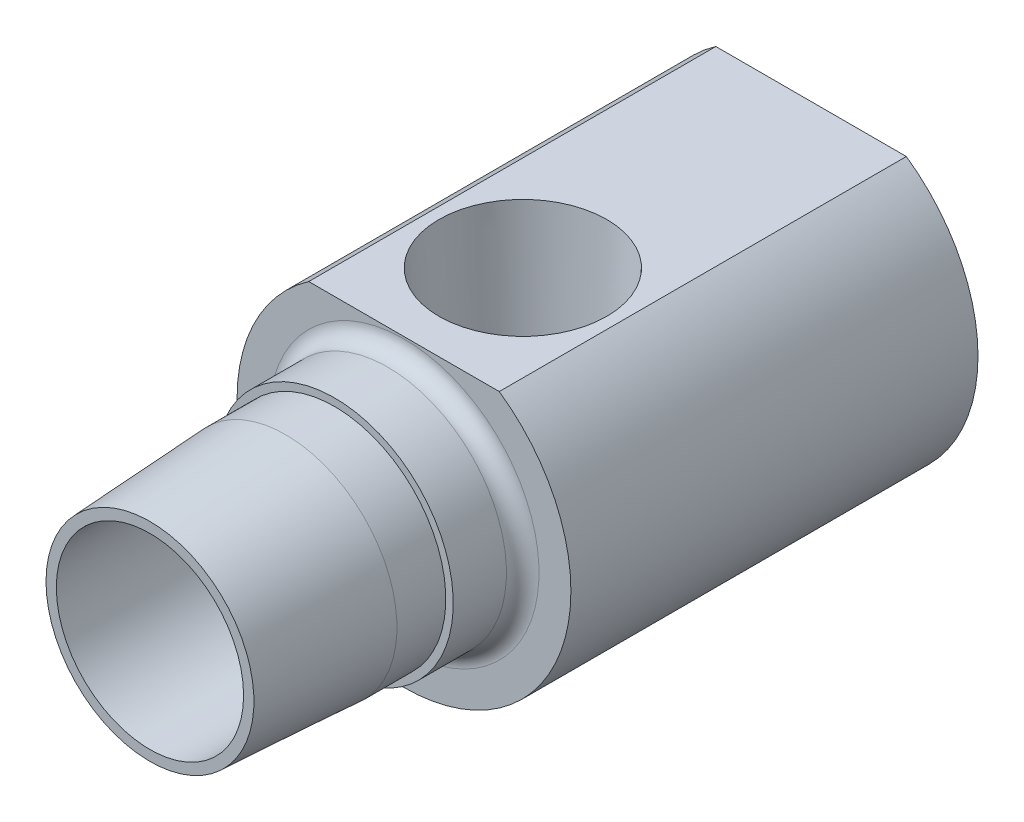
ISO-10303-21;
HEADER;
FILE_DESCRIPTION(('STEP AP214'),'2;1');
FILE_NAME('part.step','',(''),(''),'','','');
FILE_SCHEMA(('AUTOMOTIVE_DESIGN { 1 0 10303 214 1 1 1 1 }'));
ENDSEC;
DATA;
#1=APPLICATION_CONTEXT('core data for automotive mechanical design processes');
#2=APPLICATION_PROTOCOL_DEFINITION('international standard','automotive_design',2000,#1);
#3=PRODUCT_CONTEXT('',#1,'mechanical');
#4=PRODUCT('Part','Part','',(#3));
#5=PRODUCT_RELATED_PRODUCT_CATEGORY('part','',(#4));
#6=PRODUCT_DEFINITION_FORMATION('','',#4);
#7=PRODUCT_DEFINITION_CONTEXT('part definition',#1,'design');
#8=PRODUCT_DEFINITION('design','',#6,#7);
#9=PRODUCT_DEFINITION_SHAPE('','',#8);
#10=(LENGTH_UNIT() NAMED_UNIT(*) SI_UNIT(.MILLI.,.METRE.));
#11=(NAMED_UNIT(*) PLANE_ANGLE_UNIT() SI_UNIT($,.RADIAN.));
#12=(NAMED_UNIT(*) SI_UNIT($,.STERADIAN.) SOLID_ANGLE_UNIT());
#13=UNCERTAINTY_MEASURE_WITH_UNIT(LENGTH_MEASURE(1.E-05),#10,'distance_accuracy_value','');
#14=(GEOMETRIC_REPRESENTATION_CONTEXT(3) GLOBAL_UNCERTAINTY_ASSIGNED_CONTEXT((#13)) GLOBAL_UNIT_ASSIGNED_CONTEXT((#10,
#11,#12)) REPRESENTATION_CONTEXT('',''));
#15=CARTESIAN_POINT('',(0.,0.,0.));
#16=DIRECTION('',(0.,0.,1.));
#17=DIRECTION('',(1.,0.,0.));
#18=AXIS2_PLACEMENT_3D('',#15,#16,#17);
#19=CARTESIAN_POINT('',(-4.3815,0.,-8.636));
#20=DIRECTION('',(0.,0.,1.));
#21=DIRECTION('',(1.,0.,0.));
#22=AXIS2_PLACEMENT_3D('',#19,#20,#21);
#23=PLANE('',#22);
#24=CARTESIAN_POINT('',(0.,0.,-8.636));
#25=DIRECTION('',(0.,0.,-1.));
#26=DIRECTION('',(-1.,0.,0.));
#27=AXIS2_PLACEMENT_3D('',#24,#25,#26);
#28=CIRCLE('',#27,4.3815);
#29=CARTESIAN_POINT('',(-4.3815,0.,-8.636));
#30=VERTEX_POINT('',#29);
#31=EDGE_CURVE('E277',#30,#30,#28,.T.);
#32=ORIENTED_EDGE('',*,*,#31,.F.);
#33=EDGE_LOOP('',(#32));
#34=FACE_BOUND('',#33,.T.);
#35=CARTESIAN_POINT('',(0.,-0.127883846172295,-8.636));
#36=DIRECTION('',(0.,0.,1.));
#37=DIRECTION('',(0.,1.,0.));
#38=AXIS2_PLACEMENT_3D('',#35,#36,#37);
#39=ELLIPSE('',#38,3.14947653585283,3.00160671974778);
#40=CARTESIAN_POINT('',(0.,3.02159268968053,-8.636));
#41=VERTEX_POINT('',#40);
#42=EDGE_CURVE('E216',#41,#41,#39,.F.);
#43=ORIENTED_EDGE('',*,*,#42,.T.);
#44=EDGE_LOOP('',(#43));
#45=FACE_BOUND('',#44,.T.);
#46=ADVANCED_FACE('F16',(#34,#45),#23,.T.);
#47=CARTESIAN_POINT('',(-5.207,0.,-8.636));
#48=DIRECTION('',(0.,0.,1.));
#49=DIRECTION('',(1.,0.,0.));
#50=AXIS2_PLACEMENT_3D('',#47,#48,#49);
#51=PLANE('',#50);
#52=CARTESIAN_POINT('',(0.,0.,-8.636));
#53=DIRECTION('',(0.,0.,-1.));
#54=DIRECTION('',(-1.,0.,0.));
#55=AXIS2_PLACEMENT_3D('',#52,#53,#54);
#56=CIRCLE('',#55,5.207);
#57=CARTESIAN_POINT('',(-5.207,0.,-8.636));
#58=VERTEX_POINT('',#57);
#59=EDGE_CURVE('E267',#58,#58,#56,.T.);
#60=ORIENTED_EDGE('',*,*,#59,.T.);
#61=EDGE_LOOP('',(#60));
#62=FACE_BOUND('',#61,.T.);
#63=CARTESIAN_POINT('',(0.,0.,-8.636));
#64=DIRECTION('',(0.,0.,-1.));
#65=DIRECTION('',(-1.,0.,0.));
#66=AXIS2_PLACEMENT_3D('',#63,#64,#65);
#67=CIRCLE('',#66,5.55625);
#68=CARTESIAN_POINT('',(-5.55625,0.,-8.636));
#69=VERTEX_POINT('',#68);
#70=EDGE_CURVE('E292',#69,#69,#67,.T.);
#71=ORIENTED_EDGE('',*,*,#70,.F.);
#72=EDGE_LOOP('',(#71));
#73=FACE_BOUND('',#72,.T.);
#74=ADVANCED_FACE('F18',(#62,#73),#51,.T.);
#75=CARTESIAN_POINT('',(0.,0.,-75.1971669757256));
#76=DIRECTION('',(0.,0.,-1.));
#77=DIRECTION('',(-1.,0.,0.));
#78=AXIS2_PLACEMENT_3D('',#75,#76,#77);
#79=CYLINDRICAL_SURFACE('',#78,5.207);
#80=CARTESIAN_POINT('',(0.,0.,-6.35));
#81=DIRECTION('',(0.,0.,-1.));
#82=DIRECTION('',(-1.,0.,0.));
#83=AXIS2_PLACEMENT_3D('',#80,#81,#82);
#84=CIRCLE('',#83,5.207);
#85=CARTESIAN_POINT('',(-5.207,0.,-6.35));
#86=VERTEX_POINT('',#85);
#87=EDGE_CURVE('E264',#86,#86,#84,.T.);
#88=ORIENTED_EDGE('',*,*,#87,.T.);
#89=EDGE_LOOP('',(#88));
#90=FACE_BOUND('',#89,.T.);
#91=ORIENTED_EDGE('',*,*,#59,.F.);
#92=EDGE_LOOP('',(#91));
#93=FACE_BOUND('',#92,.T.);
#94=ADVANCED_FACE('F238',(#90,#93),#79,.T.);
#95=CARTESIAN_POINT('',(0.,0.,-6.35));
#96=DIRECTION('',(0.,0.,-1.));
#97=DIRECTION('',(-1.,0.,0.));
#98=AXIS2_PLACEMENT_3D('',#95,#96,#97);
#99=CONICAL_SURFACE('',#98,5.207,0.0538619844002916);
#100=CARTESIAN_POINT('',(0.,0.,0.));
#101=DIRECTION('',(0.,0.,-1.));
#102=DIRECTION('',(-1.,0.,0.));
#103=AXIS2_PLACEMENT_3D('',#100,#101,#102);
#104=CIRCLE('',#103,4.86464526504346);
#105=CARTESIAN_POINT('',(-4.86464526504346,0.,0.));
#106=VERTEX_POINT('',#105);
#107=EDGE_CURVE('E269',#106,#106,#104,.T.);
#108=ORIENTED_EDGE('',*,*,#107,.T.);
#109=EDGE_LOOP('',(#108));
#110=FACE_BOUND('',#109,.T.);
#111=ORIENTED_EDGE('',*,*,#87,.F.);
#112=EDGE_LOOP('',(#111));
#113=FACE_BOUND('',#112,.T.);
#114=ADVANCED_FACE('F253',(#110,#113),#99,.T.);
#115=CARTESIAN_POINT('',(-4.3815,0.,0.));
#116=DIRECTION('',(0.,0.,1.));
#117=DIRECTION('',(1.,0.,0.));
#118=AXIS2_PLACEMENT_3D('',#115,#116,#117);
#119=PLANE('',#118);
#120=CARTESIAN_POINT('',(0.,0.,0.));
#121=DIRECTION('',(0.,0.,-1.));
#122=DIRECTION('',(-1.,0.,0.));
#123=AXIS2_PLACEMENT_3D('',#120,#121,#122);
#124=CIRCLE('',#123,4.3815);
#125=CARTESIAN_POINT('',(-4.3815,0.,0.));
#126=VERTEX_POINT('',#125);
#127=EDGE_CURVE('E274',#126,#126,#124,.T.);
#128=ORIENTED_EDGE('',*,*,#127,.T.);
#129=EDGE_LOOP('',(#128));
#130=FACE_BOUND('',#129,.T.);
#131=ORIENTED_EDGE('',*,*,#107,.F.);
#132=EDGE_LOOP('',(#131));
#133=FACE_BOUND('',#132,.T.);
#134=ADVANCED_FACE('F249',(#130,#133),#119,.T.);
#135=CARTESIAN_POINT('',(0.,0.,-75.1971669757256));
#136=DIRECTION('',(0.,0.,-1.));
#137=DIRECTION('',(-1.,0.,0.));
#138=AXIS2_PLACEMENT_3D('',#135,#136,#137);
#139=CYLINDRICAL_SURFACE('',#138,4.3815);
#140=ORIENTED_EDGE('',*,*,#31,.T.);
#141=EDGE_LOOP('',(#140));
#142=FACE_BOUND('',#141,.T.);
#143=ORIENTED_EDGE('',*,*,#127,.F.);
#144=EDGE_LOOP('',(#143));
#145=FACE_BOUND('',#144,.T.);
#146=ADVANCED_FACE('F246',(#142,#145),#139,.F.);
#147=CARTESIAN_POINT('',(-7.8105,0.,-30.9372));
#148=DIRECTION('',(0.,0.,-1.));
#149=DIRECTION('',(-1.,0.,0.));
#150=AXIS2_PLACEMENT_3D('',#147,#148,#149);
#151=PLANE('',#150);
#152=DIRECTION('',(1.,0.,0.));
#153=VECTOR('',#152,1.);
#154=CARTESIAN_POINT('',(-2.29135888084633,3.96875,-30.9372));
#155=LINE('',#154,#153);
#156=CARTESIAN_POINT('',(-2.29135888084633,3.96875,-30.9372));
#157=VERTEX_POINT('',#156);
#158=CARTESIAN_POINT('',(2.29135888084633,3.96875,-30.9372));
#159=VERTEX_POINT('',#158);
#160=EDGE_CURVE('E37',#157,#159,#155,.T.);
#161=ORIENTED_EDGE('',*,*,#160,.F.);
#162=DIRECTION('',(0.5,0.866025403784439,0.));
#163=VECTOR('',#162,1.);
#164=CARTESIAN_POINT('',(-4.58271776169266,0.,-30.9372));
#165=LINE('',#164,#163);
#166=CARTESIAN_POINT('',(-4.58271776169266,0.,-30.9372));
#167=VERTEX_POINT('',#166);
#168=EDGE_CURVE('E128',#167,#157,#165,.T.);
#169=ORIENTED_EDGE('',*,*,#168,.F.);
#170=DIRECTION('',(-0.5,0.866025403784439,0.));
#171=VECTOR('',#170,1.);
#172=CARTESIAN_POINT('',(-2.29135888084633,-3.96875,-30.9372));
#173=LINE('',#172,#171);
#174=CARTESIAN_POINT('',(-2.29135888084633,-3.96875,-30.9372));
#175=VERTEX_POINT('',#174);
#176=EDGE_CURVE('E131',#175,#167,#173,.T.);
#177=ORIENTED_EDGE('',*,*,#176,.F.);
#178=DIRECTION('',(-1.,0.,0.));
#179=VECTOR('',#178,1.);
#180=CARTESIAN_POINT('',(2.29135888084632,-3.96875,-30.9372));
#181=LINE('',#180,#179);
#182=CARTESIAN_POINT('',(2.29135888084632,-3.96875,-30.9372));
#183=VERTEX_POINT('',#182);
#184=EDGE_CURVE('E147',#183,#175,#181,.T.);
#185=ORIENTED_EDGE('',*,*,#184,.F.);
#186=DIRECTION('',(-0.5,-0.866025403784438,0.));
#187=VECTOR('',#186,1.);
#188=CARTESIAN_POINT('',(4.58271776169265,0.,-30.9372));
#189=LINE('',#188,#187);
#190=CARTESIAN_POINT('',(4.58271776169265,0.,-30.9372));
#191=VERTEX_POINT('',#190);
#192=EDGE_CURVE('E144',#191,#183,#189,.T.);
#193=ORIENTED_EDGE('',*,*,#192,.F.);
#194=DIRECTION('',(0.5,-0.866025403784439,0.));
#195=VECTOR('',#194,1.);
#196=CARTESIAN_POINT('',(2.29135888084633,3.96875,-30.9372));
#197=LINE('',#196,#195);
#198=EDGE_CURVE('E142',#159,#191,#197,.T.);
#199=ORIENTED_EDGE('',*,*,#198,.F.);
#200=EDGE_LOOP('',(#161,#169,#177,#185,#193,#199));
#201=FACE_BOUND('',#200,.T.);
#202=DIRECTION('',(-1.,0.,0.));
#203=VECTOR('',#202,1.);
#204=CARTESIAN_POINT('',(-4.4577,6.41348742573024,-30.9372));
#205=LINE('',#204,#203);
#206=CARTESIAN_POINT('',(4.4577,6.41348742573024,-30.9372));
#207=VERTEX_POINT('',#206);
#208=CARTESIAN_POINT('',(-4.4577,6.41348742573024,-30.9372));
#209=VERTEX_POINT('',#208);
#210=EDGE_CURVE('E298',#207,#209,#205,.T.);
#211=ORIENTED_EDGE('',*,*,#210,.F.);
#212=CARTESIAN_POINT('',(0.,0.,-30.9372));
#213=DIRECTION('',(0.,0.,-1.));
#214=DIRECTION('',(-1.,0.,0.));
#215=AXIS2_PLACEMENT_3D('',#212,#213,#214);
#216=CIRCLE('',#215,7.8105);
#217=EDGE_CURVE('E280',#207,#209,#216,.T.);
#218=ORIENTED_EDGE('',*,*,#217,.T.);
#219=EDGE_LOOP('',(#211,#218));
#220=FACE_BOUND('',#219,.T.);
#221=ADVANCED_FACE('F244',(#201,#220),#151,.T.);
#222=CARTESIAN_POINT('',(0.,0.,-75.1971669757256));
#223=DIRECTION('',(0.,0.,-1.));
#224=DIRECTION('',(-1.,0.,0.));
#225=AXIS2_PLACEMENT_3D('',#222,#223,#224);
#226=CYLINDRICAL_SURFACE('',#225,7.8105);
#227=DIRECTION('',(0.,0.,-1.));
#228=VECTOR('',#227,1.);
#229=CARTESIAN_POINT('',(-4.4577,6.41348742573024,0.));
#230=LINE('',#229,#228);
#231=CARTESIAN_POINT('',(-4.4577,6.41348742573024,-11.8872));
#232=VERTEX_POINT('',#231);
#233=EDGE_CURVE('E295',#232,#209,#230,.T.);
#234=ORIENTED_EDGE('',*,*,#233,.T.);
#235=ORIENTED_EDGE('',*,*,#217,.F.);
#236=DIRECTION('',(0.,0.,-1.));
#237=VECTOR('',#236,1.);
#238=CARTESIAN_POINT('',(4.4577,6.41348742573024,0.));
#239=LINE('',#238,#237);
#240=CARTESIAN_POINT('',(4.4577,6.41348742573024,-11.8872));
#241=VERTEX_POINT('',#240);
#242=EDGE_CURVE('E296',#241,#207,#239,.T.);
#243=ORIENTED_EDGE('',*,*,#242,.F.);
#244=CARTESIAN_POINT('',(0.,0.,-11.8872));
#245=DIRECTION('',(0.,0.,-1.));
#246=DIRECTION('',(-1.,0.,0.));
#247=AXIS2_PLACEMENT_3D('',#244,#245,#246);
#248=CIRCLE('',#247,7.8105);
#249=EDGE_CURVE('E283',#241,#232,#248,.T.);
#250=ORIENTED_EDGE('',*,*,#249,.T.);
#251=EDGE_LOOP('',(#234,#235,#243,#250));
#252=FACE_BOUND('',#251,.T.);
#253=ADVANCED_FACE('F337',(#252),#226,.T.);
#254=CARTESIAN_POINT('',(-6.31825,0.,-11.8872));
#255=DIRECTION('',(0.,0.,1.));
#256=DIRECTION('',(1.,0.,0.));
#257=AXIS2_PLACEMENT_3D('',#254,#255,#256);
#258=PLANE('',#257);
#259=DIRECTION('',(1.,0.,0.));
#260=VECTOR('',#259,1.);
#261=CARTESIAN_POINT('',(-6.31825,6.41348742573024,-11.8872));
#262=LINE('',#261,#260);
#263=EDGE_CURVE('E215',#232,#241,#262,.T.);
#264=ORIENTED_EDGE('',*,*,#263,.F.);
#265=ORIENTED_EDGE('',*,*,#249,.F.);
#266=EDGE_LOOP('',(#264,#265));
#267=FACE_BOUND('',#266,.T.);
#268=CARTESIAN_POINT('',(0.,0.,-11.8872));
#269=DIRECTION('',(0.,0.,-1.));
#270=DIRECTION('',(-1.,0.,0.));
#271=AXIS2_PLACEMENT_3D('',#268,#269,#270);
#272=CIRCLE('',#271,6.31825);
#273=CARTESIAN_POINT('',(-6.31825,0.,-11.8872));
#274=VERTEX_POINT('',#273);
#275=EDGE_CURVE('E286',#274,#274,#272,.T.);
#276=ORIENTED_EDGE('',*,*,#275,.T.);
#277=EDGE_LOOP('',(#276));
#278=FACE_BOUND('',#277,.T.);
#279=ADVANCED_FACE('F334',(#267,#278),#258,.T.);
#280=CARTESIAN_POINT('',(0.,0.,-11.1252));
#281=DIRECTION('',(0.,0.,-1.));
#282=DIRECTION('',(-1.,0.,0.));
#283=AXIS2_PLACEMENT_3D('',#280,#281,#282);
#284=TOROIDAL_SURFACE('',#283,6.31825,0.762);
#285=CARTESIAN_POINT('',(0.,0.,-11.1252));
#286=DIRECTION('',(0.,0.,-1.));
#287=DIRECTION('',(-1.,0.,0.));
#288=AXIS2_PLACEMENT_3D('',#285,#286,#287);
#289=CIRCLE('',#288,5.55625);
#290=CARTESIAN_POINT('',(-5.55625,0.,-11.1252));
#291=VERTEX_POINT('',#290);
#292=EDGE_CURVE('E289',#291,#291,#289,.T.);
#293=ORIENTED_EDGE('',*,*,#292,.T.);
#294=EDGE_LOOP('',(#293));
#295=FACE_BOUND('',#294,.T.);
#296=ORIENTED_EDGE('',*,*,#275,.F.);
#297=EDGE_LOOP('',(#296));
#298=FACE_BOUND('',#297,.T.);
#299=ADVANCED_FACE('F328',(#295,#298),#284,.F.);
#300=CARTESIAN_POINT('',(0.,0.,-75.1971669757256));
#301=DIRECTION('',(0.,0.,-1.));
#302=DIRECTION('',(-1.,0.,0.));
#303=AXIS2_PLACEMENT_3D('',#300,#301,#302);
#304=CYLINDRICAL_SURFACE('',#303,5.55625);
#305=ORIENTED_EDGE('',*,*,#70,.T.);
#306=EDGE_LOOP('',(#305));
#307=FACE_BOUND('',#306,.T.);
#308=ORIENTED_EDGE('',*,*,#292,.F.);
#309=EDGE_LOOP('',(#308));
#310=FACE_BOUND('',#309,.T.);
#311=ADVANCED_FACE('F322',(#307,#310),#304,.T.);
#312=CARTESIAN_POINT('',(-4.4577,6.41348742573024,0.));
#313=DIRECTION('',(0.,-1.,0.));
#314=DIRECTION('',(0.,0.,-1.));
#315=AXIS2_PLACEMENT_3D('',#312,#313,#314);
#316=PLANE('',#315);
#317=CARTESIAN_POINT('',(0.,6.41348742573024,-17.4498));
#318=DIRECTION('',(0.,-1.,0.));
#319=DIRECTION('',(0.,0.,-1.));
#320=AXIS2_PLACEMENT_3D('',#317,#318,#319);
#321=CIRCLE('',#320,3.92693495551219);
#322=CARTESIAN_POINT('',(0.,6.41348742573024,-21.3767349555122));
#323=VERTEX_POINT('',#322);
#324=EDGE_CURVE('E154',#323,#323,#321,.T.);
#325=ORIENTED_EDGE('',*,*,#324,.T.);
#326=EDGE_LOOP('',(#325));
#327=FACE_BOUND('',#326,.T.);
#328=ORIENTED_EDGE('',*,*,#263,.T.);
#329=ORIENTED_EDGE('',*,*,#242,.T.);
#330=ORIENTED_EDGE('',*,*,#210,.T.);
#331=ORIENTED_EDGE('',*,*,#233,.F.);
#332=EDGE_LOOP('',(#328,#329,#330,#331));
#333=FACE_BOUND('',#332,.T.);
#334=ADVANCED_FACE('F317',(#327,#333),#316,.F.);
#335=CARTESIAN_POINT('',(0.,-2.98763824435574,-17.4308178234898));
#336=DIRECTION('',(0.,0.301991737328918,0.953310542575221));
#337=DIRECTION('',(0.,-0.953310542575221,0.301991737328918));
#338=AXIS2_PLACEMENT_3D('',#335,#336,#337);
#339=CONICAL_SURFACE('',#338,2.31916892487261,0.83038002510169);
#340=CARTESIAN_POINT('',(-2.31936892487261,-3.38139900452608,-17.2690017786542));
#341=CARTESIAN_POINT('',(-2.26215087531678,-3.41608583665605,-17.3083025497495));
#342=CARTESIAN_POINT('',(-2.20464250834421,-3.45050469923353,-17.3474225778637));
#343=CARTESIAN_POINT('',(-2.08890397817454,-3.51863128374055,-17.4252525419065));
#344=CARTESIAN_POINT('',(-2.03067362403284,-3.55233881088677,-17.4639623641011));
#345=CARTESIAN_POINT('',(-1.91322267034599,-3.61893821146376,-17.5410056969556));
#346=CARTESIAN_POINT('',(-1.85399982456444,-3.65182764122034,-17.5793379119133));
#347=CARTESIAN_POINT('',(-1.73457088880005,-3.7163899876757,-17.6554686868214));
#348=CARTESIAN_POINT('',(-1.67436491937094,-3.74806305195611,-17.6932673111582));
#349=CARTESIAN_POINT('',(-1.5241242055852,-3.82435670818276,-17.7859762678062));
#350=CARTESIAN_POINT('',(-1.43339975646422,-3.86804700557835,-17.8405585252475));
#351=CARTESIAN_POINT('',(-1.29500199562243,-3.92907588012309,-17.9219264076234));
#352=CARTESIAN_POINT('',(-1.2484767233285,-3.9486704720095,-17.9489690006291));
#353=CARTESIAN_POINT('',(-1.15465934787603,-3.98573397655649,-18.003169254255));
#354=CARTESIAN_POINT('',(-1.10736748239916,-4.00320353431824,-18.0303268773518));
#355=CARTESIAN_POINT('',(-1.00962894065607,-4.03591983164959,-18.0868231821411));
#356=CARTESIAN_POINT('',(-0.959148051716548,-4.0509993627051,-18.1162011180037));
#357=CARTESIAN_POINT('',(-0.858206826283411,-4.07575562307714,-18.1773154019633));
#358=CARTESIAN_POINT('',(-0.807746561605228,-4.08543995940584,-18.2090483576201));
#359=CARTESIAN_POINT('',(-0.724012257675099,-4.09439300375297,-18.2676191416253));
#360=CARTESIAN_POINT('',(-0.690088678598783,-4.09590226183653,-18.2931076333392));
#361=CARTESIAN_POINT('',(-0.625550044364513,-4.09326439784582,-18.3475794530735));
#362=CARTESIAN_POINT('',(-0.594920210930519,-4.08914378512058,-18.3765458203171));
#363=CARTESIAN_POINT('',(-0.538537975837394,-4.07534018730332,-18.4377292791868));
#364=CARTESIAN_POINT('',(-0.51279003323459,-4.06565214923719,-18.4699493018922));
#365=CARTESIAN_POINT('',(-0.466038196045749,-4.04221960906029,-18.5364415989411));
#366=CARTESIAN_POINT('',(-0.445060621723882,-4.0284535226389,-18.5707239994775));
#367=CARTESIAN_POINT('',(-0.406476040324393,-3.99832313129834,-18.6405613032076));
#368=CARTESIAN_POINT('',(-0.388912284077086,-3.98192975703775,-18.676126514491));
#369=CARTESIAN_POINT('',(-0.356106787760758,-3.94768613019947,-18.74764351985));
#370=CARTESIAN_POINT('',(-0.340867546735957,-3.92983434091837,-18.7835956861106));
#371=CARTESIAN_POINT('',(-0.297092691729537,-3.87504159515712,-18.8916073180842));
#372=CARTESIAN_POINT('',(-0.270507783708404,-3.836870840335,-18.9638055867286));
#373=CARTESIAN_POINT('',(-0.233757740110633,-3.78443658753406,-19.061307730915));
#374=CARTESIAN_POINT('',(-0.223999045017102,-3.77054391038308,-19.0869846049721));
#375=CARTESIAN_POINT('',(-0.204041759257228,-3.74272296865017,-19.1381409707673));
#376=CARTESIAN_POINT('',(-0.193843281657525,-3.72879471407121,-19.1636205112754));
#377=CARTESIAN_POINT('',(-0.169413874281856,-3.69686982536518,-19.2217969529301));
#378=CARTESIAN_POINT('',(-0.154886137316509,-3.67889603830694,-19.2543850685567));
#379=CARTESIAN_POINT('',(-0.127944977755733,-3.64958697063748,-19.3073294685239));
#380=CARTESIAN_POINT('',(-0.116509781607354,-3.63808512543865,-19.3280547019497));
#381=CARTESIAN_POINT('',(-0.0969778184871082,-3.62141131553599,-19.3580415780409));
#382=CARTESIAN_POINT('',(-0.0900448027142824,-3.61593341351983,-19.367883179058));
#383=CARTESIAN_POINT('',(-0.0749369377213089,-3.60539669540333,-19.3867972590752));
#384=CARTESIAN_POINT('',(-0.066769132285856,-3.60033573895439,-19.3958736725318));
#385=CARTESIAN_POINT('',(-0.0544283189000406,-3.59422947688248,-19.4068175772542));
#386=CARTESIAN_POINT('',(-0.05119185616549,-3.5927443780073,-19.4094785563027));
#387=CARTESIAN_POINT('',(-0.0444165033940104,-3.58993912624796,-19.4145039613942));
#388=CARTESIAN_POINT('',(-0.0408771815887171,-3.58861921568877,-19.416867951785));
#389=CARTESIAN_POINT('',(-0.0334105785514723,-3.58620483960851,-19.4211914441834));
#390=CARTESIAN_POINT('',(-0.0294787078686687,-3.58511365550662,-19.4231450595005));
#391=CARTESIAN_POINT('',(-0.0212751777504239,-3.58329721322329,-19.4263967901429));
#392=CARTESIAN_POINT('',(-0.017004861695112,-3.58257058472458,-19.4276973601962));
#393=CARTESIAN_POINT('',(-0.00948807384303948,-3.58173949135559,-19.429184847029));
#394=CARTESIAN_POINT('',(-0.00629694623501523,-3.58151668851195,-19.4295835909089));
#395=CARTESIAN_POINT('',(0.000116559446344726,-3.581343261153,-19.4298939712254));
#396=CARTESIAN_POINT('',(0.00333892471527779,-3.58139252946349,-19.4298057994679));
#397=CARTESIAN_POINT('',(0.00970917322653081,-3.58175673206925,-19.4291539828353));
#398=CARTESIAN_POINT('',(0.0128572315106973,-3.58207096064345,-19.4285916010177));
#399=CARTESIAN_POINT('',(0.0190173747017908,-3.58292996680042,-19.4270540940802));
#400=CARTESIAN_POINT('',(0.0220293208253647,-3.58347497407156,-19.4260785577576));
#401=CARTESIAN_POINT('',(0.0296007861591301,-3.58512532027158,-19.423124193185));
#402=CARTESIAN_POINT('',(0.034029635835,-3.58637173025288,-19.4208926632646));
#403=CARTESIAN_POINT('',(0.042454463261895,-3.58917242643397,-19.4158772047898));
#404=CARTESIAN_POINT('',(0.0464490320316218,-3.59072767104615,-19.413091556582));
#405=CARTESIAN_POINT('',(0.0551345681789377,-3.59450165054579,-19.4063300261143));
#406=CARTESIAN_POINT('',(0.0597066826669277,-3.59678414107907,-19.402239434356));
#407=CARTESIAN_POINT('',(0.0683868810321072,-3.60155069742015,-19.3936936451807));
#408=CARTESIAN_POINT('',(0.0724940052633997,-3.60403516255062,-19.3892377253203));
#409=CARTESIAN_POINT('',(0.0843219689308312,-3.61170500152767,-19.3754758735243));
#410=CARTESIAN_POINT('',(0.0915020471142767,-3.61708342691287,-19.3658177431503));
#411=CARTESIAN_POINT('',(0.105431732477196,-3.62845713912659,-19.3453735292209));
#412=CARTESIAN_POINT('',(0.11211764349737,-3.63446939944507,-19.3345555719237));
#413=CARTESIAN_POINT('',(0.124817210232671,-3.64665006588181,-19.3126128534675));
#414=CARTESIAN_POINT('',(0.130830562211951,-3.65281854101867,-19.3014879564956));
#415=CARTESIAN_POINT('',(0.148207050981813,-3.67148723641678,-19.2677746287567));
#416=CARTESIAN_POINT('',(0.158871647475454,-3.68411925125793,-19.2449040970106));
#417=CARTESIAN_POINT('',(0.179223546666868,-3.70950703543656,-19.1987891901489));
#418=CARTESIAN_POINT('',(0.18891007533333,-3.72226289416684,-19.175544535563));
#419=CARTESIAN_POINT('',(0.20771896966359,-3.74776824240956,-19.1288778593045));
#420=CARTESIAN_POINT('',(0.216842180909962,-3.76051771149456,-19.1054561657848));
#421=CARTESIAN_POINT('',(0.240052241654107,-3.79332430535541,-19.0448817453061));
#422=CARTESIAN_POINT('',(0.253952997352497,-3.81333633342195,-19.0076344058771));
#423=CARTESIAN_POINT('',(0.282014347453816,-3.85296976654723,-18.9329838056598));
#424=CARTESIAN_POINT('',(0.296175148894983,-3.87259083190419,-18.8955804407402));
#425=CARTESIAN_POINT('',(0.32557926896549,-3.91108663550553,-18.8208101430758));
#426=CARTESIAN_POINT('',(0.34082243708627,-3.92996147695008,-18.7834432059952));
#427=CARTESIAN_POINT('',(0.373422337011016,-3.96639371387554,-18.7090114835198));
#428=CARTESIAN_POINT('',(0.390777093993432,-3.98395231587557,-18.6719464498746));
#429=CARTESIAN_POINT('',(0.429995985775,-4.01763662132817,-18.5966600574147));
#430=CARTESIAN_POINT('',(0.452045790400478,-4.03364259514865,-18.5584769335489));
#431=CARTESIAN_POINT('',(0.501705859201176,-4.06101241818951,-18.4844649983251));
#432=CARTESIAN_POINT('',(0.529262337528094,-4.07241817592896,-18.4486175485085));
#433=CARTESIAN_POINT('',(0.590795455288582,-4.08865572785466,-18.3803597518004));
#434=CARTESIAN_POINT('',(0.624839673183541,-4.09341348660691,-18.3479917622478));
#435=CARTESIAN_POINT('',(0.697042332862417,-4.09598814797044,-18.2874485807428));
#436=CARTESIAN_POINT('',(0.735235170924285,-4.0937419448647,-18.259313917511));
#437=CARTESIAN_POINT('',(0.823212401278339,-4.08276685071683,-18.1990865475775));
#438=CARTESIAN_POINT('',(0.873388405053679,-4.07247897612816,-18.1679182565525));
#439=CARTESIAN_POINT('',(0.97373567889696,-4.04681704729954,-18.1076401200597));
#440=CARTESIAN_POINT('',(1.0239065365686,-4.03142873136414,-18.0785363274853));
#441=CARTESIAN_POINT('',(1.12405342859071,-3.99723396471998,-18.0207248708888));
#442=CARTESIAN_POINT('',(1.17402177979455,-3.9783930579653,-17.9920246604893));
#443=CARTESIAN_POINT('',(1.27300982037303,-3.93849561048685,-17.9347281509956));
#444=CARTESIAN_POINT('',(1.32203070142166,-3.9174421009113,-17.9061317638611));
#445=CARTESIAN_POINT('',(1.45488437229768,-3.85772407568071,-17.8276549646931));
#446=CARTESIAN_POINT('',(1.53786963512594,-3.817471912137,-17.7775525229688));
#447=CARTESIAN_POINT('',(1.70177867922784,-3.73404077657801,-17.6762869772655));
#448=CARTESIAN_POINT('',(1.78270067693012,-3.69085938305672,-17.6251230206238));
#449=CARTESIAN_POINT('',(1.94030818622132,-3.60395670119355,-17.5235017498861));
#450=CARTESIAN_POINT('',(2.01704653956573,-3.56029641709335,-17.4730738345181));
#451=CARTESIAN_POINT('',(2.16914109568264,-3.47169762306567,-17.3715344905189));
#452=CARTESIAN_POINT('',(2.24449902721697,-3.42676092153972,-17.3204240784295));
#453=CARTESIAN_POINT('',(2.31936892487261,-3.38139900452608,-17.2690017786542));
#454=B_SPLINE_CURVE_WITH_KNOTS('',3,(#340,#341,#342,#343,#344,#345,#346,#347,#348,#349,#350,
#351,#352,#353,#354,#355,#356,#357,#358,#359,#360,#361,#362,#363,#364,#365,#366,#367,#368,#369,
#370,#371,#372,#373,#374,#375,#376,#377,#378,#379,#380,#381,#382,#383,#384,#385,#386,#387,#388,
#389,#390,#391,#392,#393,#394,#395,#396,#397,#398,#399,#400,#401,#402,#403,#404,#405,#406,#407,
#408,#409,#410,#411,#412,#413,#414,#415,#416,#417,#418,#419,#420,#421,#422,#423,#424,#425,#426,
#427,#428,#429,#430,#431,#432,#433,#434,#435,#436,#437,#438,#439,#440,#441,#442,#443,#444,#445,
#446,#447,#448,#449,#450,#451,#452,#453),.UNSPECIFIED.,.F.,.F.,(4,2,2,2,2,2,2,2,2,2,2,2,2,2,2,2,
2,2,2,2,2,2,2,2,2,2,2,2,2,2,2,2,2,2,2,2,2,2,2,2,2,2,2,2,2,2,2,2,2,2,2,2,2,2,2,2,4),(0.,
0.232800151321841,0.465663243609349,0.699154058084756,0.932616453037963,1.27606998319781,
1.4478508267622,1.61957939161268,1.80042335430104,1.98101168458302,2.10791280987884,
2.23421845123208,2.36063890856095,2.48774081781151,2.61636083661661,2.74511817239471,
3.00269155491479,3.09503971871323,3.18736428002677,3.30716529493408,3.38596222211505,
3.42561323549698,3.46504604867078,3.47836503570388,3.49170333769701,3.50522157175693,
3.51868860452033,3.52831482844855,3.53793726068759,3.54753414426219,3.5571406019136,
3.57239218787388,3.58769186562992,3.60728210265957,3.62691206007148,3.6663721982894,
3.7085497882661,3.75074634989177,3.835359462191,3.92003901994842,4.00458821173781,
4.13811501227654,4.27175317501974,4.40537279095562,4.53886838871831,4.67921285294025,
4.81824820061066,4.95881989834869,5.10066179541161,5.28005992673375,5.45996397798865,
5.6417722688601,5.82333466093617,6.13811092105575,6.45315064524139,6.75815593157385,
7.06274875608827),.UNSPECIFIED.);
#455=CARTESIAN_POINT('',(-2.27707437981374,-3.40696136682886,-17.2979837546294));
#456=VERTEX_POINT('',#455);
#457=CARTESIAN_POINT('',(2.27707437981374,-3.40696136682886,-17.2979837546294));
#458=VERTEX_POINT('',#457);
#459=EDGE_CURVE('E170',#456,#458,#454,.T.);
#460=ORIENTED_EDGE('',*,*,#459,.F.);
#461=CARTESIAN_POINT('',(0.,-2.98763824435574,-17.4308178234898));
#462=DIRECTION('',(0.,-0.301991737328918,-0.953310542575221));
#463=DIRECTION('',(0.,0.953310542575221,-0.301991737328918));
#464=AXIS2_PLACEMENT_3D('',#461,#462,#463);
#465=CIRCLE('',#464,2.31916892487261);
#466=EDGE_CURVE('E177',#458,#456,#465,.T.);
#467=ORIENTED_EDGE('',*,*,#466,.F.);
#468=EDGE_LOOP('',(#460,#467));
#469=FACE_BOUND('',#468,.T.);
#470=CARTESIAN_POINT('',(0.,-3.62767348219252,-19.451245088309));
#471=VERTEX_POINT('',#470);
#472=VERTEX_LOOP('',#471);
#473=FACE_BOUND('',#472,.T.);
#474=ADVANCED_FACE('F179',(#469,#473),#339,.F.);
#475=CARTESIAN_POINT('',(0.,0.411931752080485,-6.69924633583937));
#476=DIRECTION('',(0.,0.301991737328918,0.953310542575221));
#477=DIRECTION('',(0.,-0.953310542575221,0.301991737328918));
#478=AXIS2_PLACEMENT_3D('',#475,#476,#477);
#479=CONICAL_SURFACE('',#478,3.15088667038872,0.0737494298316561);
#480=CARTESIAN_POINT('',(2.25666996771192,-3.36353019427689,-18.1313876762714));
#481=CARTESIAN_POINT('',(2.25873575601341,-3.37130047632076,-18.0780035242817));
#482=CARTESIAN_POINT('',(2.2605095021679,-3.37826943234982,-18.0244928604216));
#483=CARTESIAN_POINT('',(2.26364506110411,-3.39040567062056,-17.9172415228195));
#484=CARTESIAN_POINT('',(2.26500676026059,-3.39557245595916,-17.8635007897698));
#485=CARTESIAN_POINT('',(2.26873161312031,-3.40806787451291,-17.7019753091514));
#486=CARTESIAN_POINT('',(2.2707333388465,-3.41238595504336,-17.5939240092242));
#487=CARTESIAN_POINT('',(2.27509789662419,-3.41182546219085,-17.3800371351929));
#488=CARTESIAN_POINT('',(2.27745256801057,-3.40713190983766,-17.2742011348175));
#489=CARTESIAN_POINT('',(2.28351002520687,-3.38878155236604,-17.0634358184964));
#490=CARTESIAN_POINT('',(2.28721178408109,-3.37513156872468,-16.958505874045));
#491=CARTESIAN_POINT('',(2.29732889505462,-3.33606554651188,-16.728349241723));
#492=CARTESIAN_POINT('',(2.30414954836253,-3.30878739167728,-16.6034610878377));
#493=CARTESIAN_POINT('',(2.32015180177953,-3.2450223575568,-16.3560516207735));
#494=CARTESIAN_POINT('',(2.3293376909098,-3.20851875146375,-16.2335350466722));
#495=CARTESIAN_POINT('',(2.34966117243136,-3.12784948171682,-15.9875844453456));
#496=CARTESIAN_POINT('',(2.36084456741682,-3.0835043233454,-15.8642141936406));
#497=CARTESIAN_POINT('',(2.37839457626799,-3.01344522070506,-15.6809083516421));
#498=CARTESIAN_POINT('',(2.38436058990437,-2.98955503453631,-15.6202217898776));
#499=CARTESIAN_POINT('',(2.39648603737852,-2.94075927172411,-15.4992928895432));
#500=CARTESIAN_POINT('',(2.40264542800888,-2.91585392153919,-15.4390504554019));
#501=CARTESIAN_POINT('',(2.40886748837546,-2.89052921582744,-15.3789911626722));
#502=B_SPLINE_CURVE_WITH_KNOTS('',3,(#480,#481,#482,#483,#484,#485,#486,#487,#488,#489,#490,
#491,#492,#493,#494,#495,#496,#497,#498,#499,#500,#501),.UNSPECIFIED.,.F.,.F.,(4,2,2,2,2,2,2,2,
2,2,4),(0.,0.161946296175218,0.323937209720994,0.648030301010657,0.965540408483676,
1.28280897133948,1.66634771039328,2.05058690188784,2.44514862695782,2.64161796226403,
2.83804370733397),.UNSPECIFIED.);
#503=CARTESIAN_POINT('',(2.40881834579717,-2.890729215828,-15.3794654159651));
#504=VERTEX_POINT('',#503);
#505=EDGE_CURVE('E10',#458,#504,#502,.T.);
#506=ORIENTED_EDGE('',*,*,#505,.F.);
#507=ORIENTED_EDGE('',*,*,#466,.T.);
#508=CARTESIAN_POINT('',(-2.40886748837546,-2.89052921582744,-15.3789911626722));
#509=CARTESIAN_POINT('',(-2.4019906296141,-2.91851931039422,-15.4453830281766));
#510=CARTESIAN_POINT('',(-2.39518829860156,-2.94600505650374,-15.5120007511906));
#511=CARTESIAN_POINT('',(-2.3818284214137,-2.99971424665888,-15.6457919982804));
#512=CARTESIAN_POINT('',(-2.37527095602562,-3.02593727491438,-15.7129656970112));
#513=CARTESIAN_POINT('',(-2.36246362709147,-3.07699843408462,-15.8483264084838));
#514=CARTESIAN_POINT('',(-2.35621579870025,-3.10182751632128,-15.916517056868));
#515=CARTESIAN_POINT('',(-2.34418837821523,-3.14957966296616,-16.0535946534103));
#516=CARTESIAN_POINT('',(-2.33840874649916,-3.17250288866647,-16.1224815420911));
#517=CARTESIAN_POINT('',(-2.32228911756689,-3.23652361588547,-16.3261843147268));
#518=CARTESIAN_POINT('',(-2.31276968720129,-3.27444828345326,-16.4621006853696));
#519=CARTESIAN_POINT('',(-2.2968246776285,-3.33792577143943,-16.7367148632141));
#520=CARTESIAN_POINT('',(-2.2903909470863,-3.36351118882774,-16.8754043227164));
#521=CARTESIAN_POINT('',(-2.28213933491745,-3.39315831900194,-17.1067693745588));
#522=CARTESIAN_POINT('',(-2.27949494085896,-3.40159655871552,-17.1988611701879));
#523=CARTESIAN_POINT('',(-2.27498435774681,-3.41160250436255,-17.3835236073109));
#524=CARTESIAN_POINT('',(-2.27311887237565,-3.41316400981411,-17.4760946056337));
#525=CARTESIAN_POINT('',(-2.26940346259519,-3.40967086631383,-17.6628479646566));
#526=CARTESIAN_POINT('',(-2.26755450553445,-3.40449008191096,-17.7570275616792));
#527=CARTESIAN_POINT('',(-2.26299047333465,-3.38821248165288,-17.9447506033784));
#528=CARTESIAN_POINT('',(-2.26027640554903,-3.37712253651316,-18.0382946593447));
#529=CARTESIAN_POINT('',(-2.25666996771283,-3.36353019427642,-18.1313876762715));
#530=B_SPLINE_CURVE_WITH_KNOTS('',3,(#508,#509,#510,#511,#512,#513,#514,#515,#516,#517,#518,
#519,#520,#521,#522,#523,#524,#525,#526,#527,#528,#529),.UNSPECIFIED.,.F.,.F.,(4,2,2,2,2,2,2,2,
2,2,4),(0.,0.217139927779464,0.434350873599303,0.6528388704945,0.871308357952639,
1.2951539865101,1.71787371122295,1.99517262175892,2.27272151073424,2.55553820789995,
2.83802678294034),.UNSPECIFIED.);
#531=CARTESIAN_POINT('',(-2.40881834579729,-2.89072921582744,-15.3794654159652));
#532=VERTEX_POINT('',#531);
#533=EDGE_CURVE('E30',#532,#456,#530,.T.);
#534=ORIENTED_EDGE('',*,*,#533,.F.);
#535=CARTESIAN_POINT('',(2.40877236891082,-2.89092921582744,-15.3794119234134));
#536=CARTESIAN_POINT('',(2.42085743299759,-2.83844633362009,-15.3934906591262));
#537=CARTESIAN_POINT('',(2.4311983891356,-2.78507386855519,-15.4057534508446));
#538=CARTESIAN_POINT('',(2.44843465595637,-2.67709065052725,-15.4264215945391));
#539=CARTESIAN_POINT('',(2.45533295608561,-2.62248101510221,-15.4348302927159));
#540=CARTESIAN_POINT('',(2.46567624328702,-2.51322221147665,-15.447502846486));
#541=CARTESIAN_POINT('',(2.46916708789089,-2.45858376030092,-15.4518217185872));
#542=CARTESIAN_POINT('',(2.47300637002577,-2.34903967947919,-15.4565772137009));
#543=CARTESIAN_POINT('',(2.47335450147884,-2.29413402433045,-15.457013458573));
#544=CARTESIAN_POINT('',(2.46997504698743,-2.13005729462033,-15.4528136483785));
#545=CARTESIAN_POINT('',(2.46186228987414,-2.02107959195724,-15.4427172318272));
#546=CARTESIAN_POINT('',(2.43558739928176,-1.80584898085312,-15.410927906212));
#547=CARTESIAN_POINT('',(2.41738591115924,-1.69960845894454,-15.3891895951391));
#548=CARTESIAN_POINT('',(2.37511667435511,-1.50421573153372,-15.3406739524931));
#549=CARTESIAN_POINT('',(2.35206868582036,-1.41458938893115,-15.3148682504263));
#550=CARTESIAN_POINT('',(2.29985701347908,-1.23855314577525,-15.2587229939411));
#551=CARTESIAN_POINT('',(2.27068902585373,-1.15214555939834,-15.2283802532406));
#552=CARTESIAN_POINT('',(2.20643472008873,-0.982442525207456,-15.1645438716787));
#553=CARTESIAN_POINT('',(2.17133056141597,-0.899157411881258,-15.1310408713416));
#554=CARTESIAN_POINT('',(2.09534204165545,-0.736111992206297,-15.0621518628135));
#555=CARTESIAN_POINT('',(2.05445914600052,-0.656350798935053,-15.0267663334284));
#556=CARTESIAN_POINT('',(1.96446360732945,-0.496377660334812,-14.9531757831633));
#557=CARTESIAN_POINT('',(1.91502775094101,-0.416369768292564,-14.9149211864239));
#558=CARTESIAN_POINT('',(1.80935158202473,-0.260903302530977,-14.8384410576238));
#559=CARTESIAN_POINT('',(1.75310905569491,-0.185446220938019,-14.8002155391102));
#560=CARTESIAN_POINT('',(1.63370079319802,-0.0400923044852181,-14.724974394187));
#561=CARTESIAN_POINT('',(1.57056231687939,0.0298246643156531,-14.6879547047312));
#562=CARTESIAN_POINT('',(1.43686807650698,0.163325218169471,-14.616100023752));
#563=CARTESIAN_POINT('',(1.36631880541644,0.226914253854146,-14.5812631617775));
#564=CARTESIAN_POINT('',(1.20782083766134,0.354137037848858,-14.5106970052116));
#565=CARTESIAN_POINT('',(1.11880171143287,0.416716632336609,-14.4754331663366));
#566=CARTESIAN_POINT('',(0.9309507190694,0.529248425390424,-14.4114071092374));
#567=CARTESIAN_POINT('',(0.832130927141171,0.579215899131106,-14.3826370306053));
#568=CARTESIAN_POINT('',(0.64118572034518,0.656948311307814,-14.3376139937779));
#569=CARTESIAN_POINT('',(0.55025682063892,0.686912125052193,-14.320134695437));
#570=CARTESIAN_POINT('',(0.363854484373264,0.733238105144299,-14.2930382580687));
#571=CARTESIAN_POINT('',(0.268384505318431,0.74961044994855,-14.2834152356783));
#572=CARTESIAN_POINT('',(0.0751659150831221,0.767426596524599,-14.27294130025));
#573=CARTESIAN_POINT('',(-0.0225902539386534,0.768810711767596,-14.2721254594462));
#574=CARTESIAN_POINT('',(-0.216785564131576,0.756363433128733,-14.2794462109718));
#575=CARTESIAN_POINT('',(-0.313224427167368,0.742528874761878,-14.2875846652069));
#576=CARTESIAN_POINT('',(-0.496249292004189,0.702105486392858,-14.3112577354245));
#577=CARTESIAN_POINT('',(-0.583080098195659,0.676324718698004,-14.3263233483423));
#578=CARTESIAN_POINT('',(-0.751428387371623,0.614048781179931,-14.3624915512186));
#579=CARTESIAN_POINT('',(-0.832943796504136,0.577549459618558,-14.3835964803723));
#580=CARTESIAN_POINT('',(-1.0297326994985,0.474762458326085,-14.4425421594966));
#581=CARTESIAN_POINT('',(-1.14110372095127,0.402763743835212,-14.4834368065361));
#582=CARTESIAN_POINT('',(-1.34939640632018,0.243621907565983,-14.5721770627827));
#583=CARTESIAN_POINT('',(-1.44627901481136,0.156439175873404,-14.6200407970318));
#584=CARTESIAN_POINT('',(-1.60172744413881,-0.00407459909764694,-14.7059422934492));
#585=CARTESIAN_POINT('',(-1.66356320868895,-0.0747596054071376,-14.7431291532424));
#586=CARTESIAN_POINT('',(-1.78026515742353,-0.221272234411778,-14.8184177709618));
#587=CARTESIAN_POINT('',(-1.83512768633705,-0.297102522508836,-14.8565199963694));
#588=CARTESIAN_POINT('',(-1.93826805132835,-0.453345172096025,-14.9326740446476));
#589=CARTESIAN_POINT('',(-1.98653383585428,-0.533765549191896,-14.9707256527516));
#590=CARTESIAN_POINT('',(-2.07659201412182,-0.698638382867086,-15.0456609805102));
#591=CARTESIAN_POINT('',(-2.11838632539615,-0.783089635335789,-15.0825450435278));
#592=CARTESIAN_POINT('',(-2.18946110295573,-0.942095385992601,-15.1482987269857));
#593=CARTESIAN_POINT('',(-2.21967484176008,-1.01609227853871,-15.1775110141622));
#594=CARTESIAN_POINT('',(-2.27552489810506,-1.16673775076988,-15.2334428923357));
#595=CARTESIAN_POINT('',(-2.30116049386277,-1.2433867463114,-15.2601620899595));
#596=CARTESIAN_POINT('',(-2.34757621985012,-1.39903391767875,-15.3100024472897));
#597=CARTESIAN_POINT('',(-2.36837054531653,-1.47802443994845,-15.3331340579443));
#598=CARTESIAN_POINT('',(-2.40481275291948,-1.63837284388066,-15.3746303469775));
#599=CARTESIAN_POINT('',(-2.42046386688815,-1.71972920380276,-15.3929980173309));
#600=CARTESIAN_POINT('',(-2.44958225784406,-1.90712508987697,-15.4276990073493));
#601=CARTESIAN_POINT('',(-2.46128099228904,-2.01382885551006,-15.4421013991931));
#602=CARTESIAN_POINT('',(-2.47381227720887,-2.2286890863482,-15.4575462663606));
#603=CARTESIAN_POINT('',(-2.47467747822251,-2.33684020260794,-15.4586288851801));
#604=CARTESIAN_POINT('',(-2.4656413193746,-2.52011587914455,-15.4474716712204));
#605=CARTESIAN_POINT('',(-2.45882159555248,-2.59562867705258,-15.4390439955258));
#606=CARTESIAN_POINT('',(-2.44375102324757,-2.70750663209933,-15.4208020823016));
#607=CARTESIAN_POINT('',(-2.43789647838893,-2.74467363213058,-15.4137592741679));
#608=CARTESIAN_POINT('',(-2.42455796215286,-2.81833886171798,-15.3978948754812));
#609=CARTESIAN_POINT('',(-2.41707362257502,-2.8548369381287,-15.3890728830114));
#610=CARTESIAN_POINT('',(-2.40877236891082,-2.89092921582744,-15.3794119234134));
#611=B_SPLINE_CURVE_WITH_KNOTS('',3,(#535,#536,#537,#538,#539,#540,#541,#542,#543,#544,#545,
#546,#547,#548,#549,#550,#551,#552,#553,#554,#555,#556,#557,#558,#559,#560,#561,#562,#563,#564,
#565,#566,#567,#568,#569,#570,#571,#572,#573,#574,#575,#576,#577,#578,#579,#580,#581,#582,#583,
#584,#585,#586,#587,#588,#589,#590,#591,#592,#593,#594,#595,#596,#597,#598,#599,#600,#601,#602,
#603,#604,#605,#606,#607,#608,#609,#610),.UNSPECIFIED.,.F.,.F.,(4,2,2,2,2,2,2,2,2,2,2,2,2,2,2,2,
2,2,2,2,2,2,2,2,2,2,2,2,2,2,2,2,2,2,2,2,2,4),(0.,0.166937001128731,0.333728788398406,
0.498243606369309,0.662774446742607,0.990501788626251,1.31951663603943,1.60733897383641,
1.89536440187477,2.18427136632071,2.47310519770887,2.77738706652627,3.08176816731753,
3.38498684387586,3.68794203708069,4.03001059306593,4.37166284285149,4.66240771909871,
4.95293466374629,5.2446181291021,5.53636225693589,5.81074344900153,6.08523106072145,
6.49924442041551,6.91435443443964,7.21700621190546,7.5198159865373,7.82317177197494,
8.12643749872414,8.38155240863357,8.63670750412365,8.89110475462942,9.14534184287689,
9.46912518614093,9.79193246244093,10.0201159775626,10.1348783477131,10.2496666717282),.UNSPECIFIED.);
#612=EDGE_CURVE('E199',#504,#532,#611,.T.);
#613=ORIENTED_EDGE('',*,*,#612,.F.);
#614=EDGE_LOOP('',(#506,#507,#534,#613));
#615=FACE_BOUND('',#614,.T.);
#616=CARTESIAN_POINT('',(0.,0.89535,-2.50317675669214));
#617=DIRECTION('',(0.,-1.,0.));
#618=DIRECTION('',(0.,0.,1.));
#619=AXIS2_PLACEMENT_3D('',#616,#617,#618);
#620=ELLIPSE('',#619,11.4480553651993,3.36187270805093);
#621=CARTESIAN_POINT('',(-0.462976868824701,0.89535,-13.8421554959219));
#622=VERTEX_POINT('',#621);
#623=CARTESIAN_POINT('',(0.462976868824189,0.89535,-13.8421554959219));
#624=VERTEX_POINT('',#623);
#625=EDGE_CURVE('E205',#622,#624,#620,.T.);
#626=ORIENTED_EDGE('',*,*,#625,.F.);
#627=CARTESIAN_POINT('',(0.994068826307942,0.682525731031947,-13.9626638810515));
#628=CARTESIAN_POINT('',(0.951643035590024,0.706488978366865,-13.9492624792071));
#629=CARTESIAN_POINT('',(0.908295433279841,0.729173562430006,-13.9365179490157));
#630=CARTESIAN_POINT('',(0.819791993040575,0.771733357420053,-13.912523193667));
#631=CARTESIAN_POINT('',(0.774634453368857,0.791605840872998,-13.9012744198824));
#632=CARTESIAN_POINT('',(0.636290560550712,0.846693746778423,-13.8700045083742));
#633=CARTESIAN_POINT('',(0.540543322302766,0.877200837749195,-13.8525603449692));
#634=CARTESIAN_POINT('',(0.34381207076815,0.923526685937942,-13.8260036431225));
#635=CARTESIAN_POINT('',(0.242801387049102,0.939260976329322,-13.8169390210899));
#636=CARTESIAN_POINT('',(0.0394257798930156,0.954307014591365,-13.8082719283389));
#637=CARTESIAN_POINT('',(-0.0629339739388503,0.953669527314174,-13.8086402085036));
#638=CARTESIAN_POINT('',(-0.258183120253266,0.936824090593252,-13.818341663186));
#639=CARTESIAN_POINT('',(-0.351211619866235,0.92177508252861,-13.8270075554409));
#640=CARTESIAN_POINT('',(-0.533428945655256,0.878885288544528,-13.851594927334));
#641=CARTESIAN_POINT('',(-0.622610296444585,0.851020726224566,-13.8675298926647));
#642=CARTESIAN_POINT('',(-0.758530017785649,0.798483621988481,-13.897377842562));
#643=CARTESIAN_POINT('',(-0.807199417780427,0.777486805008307,-13.9092723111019));
#644=CARTESIAN_POINT('',(-0.90228370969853,0.732311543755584,-13.9347546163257));
#645=CARTESIAN_POINT('',(-0.948708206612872,0.708148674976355,-13.9483341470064));
#646=CARTESIAN_POINT('',(-0.994068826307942,0.682525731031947,-13.9626638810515));
#647=B_SPLINE_CURVE_WITH_KNOTS('',3,(#627,#628,#629,#630,#631,#632,#633,#634,#635,#636,#637,
#638,#639,#640,#641,#642,#643,#644,#645,#646),.UNSPECIFIED.,.F.,.F.,(4,2,2,2,2,2,2,2,2,4),(0.,
0.151552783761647,0.303251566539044,0.60775403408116,0.91398714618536,1.21927081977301,
1.50190043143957,1.78505652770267,1.94788099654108,2.10993257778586),.UNSPECIFIED.);
#648=EDGE_CURVE('E208',#624,#622,#647,.T.);
#649=ORIENTED_EDGE('',*,*,#648,.F.);
#650=EDGE_LOOP('',(#626,#649));
#651=FACE_BOUND('',#650,.T.);
#652=ORIENTED_EDGE('',*,*,#42,.F.);
#653=EDGE_LOOP('',(#652));
#654=FACE_BOUND('',#653,.T.);
#655=ADVANCED_FACE('F187',(#615,#651,#654),#479,.F.);
#656=CARTESIAN_POINT('',(0.,-4.72454955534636,-17.4498));
#657=DIRECTION('',(0.,1.,0.));
#658=DIRECTION('',(0.,0.,1.));
#659=AXIS2_PLACEMENT_3D('',#656,#657,#658);
#660=CONICAL_SURFACE('',#659,0.,1.0471975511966);
#661=ORIENTED_EDGE('',*,*,#505,.T.);
#662=CARTESIAN_POINT('',(0.,-2.89072921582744,-17.4498));
#663=DIRECTION('',(0.,-1.,0.));
#664=DIRECTION('',(0.,0.,-1.));
#665=AXIS2_PLACEMENT_3D('',#662,#663,#664);
#666=CIRCLE('',#665,3.17627);
#667=EDGE_CURVE('E44',#532,#504,#666,.T.);
#668=ORIENTED_EDGE('',*,*,#667,.F.);
#669=ORIENTED_EDGE('',*,*,#533,.T.);
#670=ORIENTED_EDGE('',*,*,#459,.T.);
#671=EDGE_LOOP('',(#661,#668,#669,#670));
#672=FACE_BOUND('',#671,.T.);
#673=ADVANCED_FACE('F182',(#672),#660,.F.);
#674=CARTESIAN_POINT('',(0.,6.41348742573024,-17.4498));
#675=DIRECTION('',(0.,-1.,0.));
#676=DIRECTION('',(0.,0.,-1.));
#677=AXIS2_PLACEMENT_3D('',#674,#675,#676);
#678=CYLINDRICAL_SURFACE('',#677,3.17627);
#679=ORIENTED_EDGE('',*,*,#612,.T.);
#680=ORIENTED_EDGE('',*,*,#667,.T.);
#681=EDGE_LOOP('',(#679,#680));
#682=FACE_BOUND('',#681,.T.);
#683=CARTESIAN_POINT('',(0.,0.89535,-17.4498));
#684=DIRECTION('',(0.,-1.,0.));
#685=DIRECTION('',(0.,0.,-1.));
#686=AXIS2_PLACEMENT_3D('',#683,#684,#685);
#687=CIRCLE('',#686,3.17627);
#688=CARTESIAN_POINT('',(0.,0.89535,-20.62607));
#689=VERTEX_POINT('',#688);
#690=EDGE_CURVE('E166',#689,#689,#687,.T.);
#691=ORIENTED_EDGE('',*,*,#690,.F.);
#692=EDGE_LOOP('',(#691));
#693=FACE_BOUND('',#692,.T.);
#694=ADVANCED_FACE('F186',(#682,#693),#678,.F.);
#695=CARTESIAN_POINT('',(0.,0.89535,-21.0870306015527));
#696=DIRECTION('',(0.,-1.,0.));
#697=DIRECTION('',(0.,0.,-1.));
#698=AXIS2_PLACEMENT_3D('',#695,#696,#697);
#699=PLANE('',#698);
#700=ORIENTED_EDGE('',*,*,#625,.T.);
#701=CARTESIAN_POINT('',(0.,0.89535,-17.4498));
#702=DIRECTION('',(0.,-1.,0.));
#703=DIRECTION('',(0.,0.,-1.));
#704=AXIS2_PLACEMENT_3D('',#701,#702,#703);
#705=CIRCLE('',#704,3.6372306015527);
#706=EDGE_CURVE('E164',#622,#624,#705,.T.);
#707=ORIENTED_EDGE('',*,*,#706,.F.);
#708=EDGE_LOOP('',(#700,#707));
#709=FACE_BOUND('',#708,.T.);
#710=ORIENTED_EDGE('',*,*,#690,.T.);
#711=EDGE_LOOP('',(#710));
#712=FACE_BOUND('',#711,.T.);
#713=ADVANCED_FACE('F222',(#709,#712),#699,.F.);
#714=CARTESIAN_POINT('',(0.,0.89535,-17.4498));
#715=DIRECTION('',(0.,1.,0.));
#716=DIRECTION('',(0.,0.,1.));
#717=AXIS2_PLACEMENT_3D('',#714,#715,#716);
#718=CONICAL_SURFACE('',#717,3.6372306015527,0.0524522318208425);
#719=ORIENTED_EDGE('',*,*,#648,.T.);
#720=ORIENTED_EDGE('',*,*,#706,.T.);
#721=EDGE_LOOP('',(#719,#720));
#722=FACE_BOUND('',#721,.T.);
#723=ORIENTED_EDGE('',*,*,#324,.F.);
#724=EDGE_LOOP('',(#723));
#725=FACE_BOUND('',#724,.T.);
#726=ADVANCED_FACE('F218',(#722,#725),#718,.F.);
#727=CARTESIAN_POINT('',(-2.29135888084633,3.96875,-26.1112));
#728=DIRECTION('',(0.,1.,0.));
#729=DIRECTION('',(-1.,0.,0.));
#730=AXIS2_PLACEMENT_3D('',#727,#728,#729);
#731=PLANE('',#730);
#732=ORIENTED_EDGE('',*,*,#160,.T.);
#733=DIRECTION('',(0.,0.,-1.));
#734=VECTOR('',#733,1.);
#735=CARTESIAN_POINT('',(2.29135888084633,3.96875,-26.1112));
#736=LINE('',#735,#734);
#737=CARTESIAN_POINT('',(2.29135888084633,3.96875,-26.1112));
#738=VERTEX_POINT('',#737);
#739=EDGE_CURVE('E105',#738,#159,#736,.T.);
#740=ORIENTED_EDGE('',*,*,#739,.F.);
#741=DIRECTION('',(1.,0.,0.));
#742=VECTOR('',#741,1.);
#743=CARTESIAN_POINT('',(-2.29135888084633,3.96875,-26.1112));
#744=LINE('',#743,#742);
#745=CARTESIAN_POINT('',(-2.29135888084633,3.96875,-26.1112));
#746=VERTEX_POINT('',#745);
#747=EDGE_CURVE('E109',#746,#738,#744,.T.);
#748=ORIENTED_EDGE('',*,*,#747,.F.);
#749=DIRECTION('',(0.,0.,-1.));
#750=VECTOR('',#749,1.);
#751=CARTESIAN_POINT('',(-2.29135888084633,3.96875,-26.1112));
#752=LINE('',#751,#750);
#753=EDGE_CURVE('E152',#746,#157,#752,.T.);
#754=ORIENTED_EDGE('',*,*,#753,.T.);
#755=EDGE_LOOP('',(#732,#740,#748,#754));
#756=FACE_BOUND('',#755,.T.);
#757=ADVANCED_FACE('F107',(#756),#731,.F.);
#758=CARTESIAN_POINT('',(-4.58271776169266,0.,-26.1112));
#759=DIRECTION('',(-0.866025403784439,0.5,0.));
#760=DIRECTION('',(-0.5,-0.866025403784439,0.));
#761=AXIS2_PLACEMENT_3D('',#758,#759,#760);
#762=PLANE('',#761);
#763=ORIENTED_EDGE('',*,*,#168,.T.);
#764=ORIENTED_EDGE('',*,*,#753,.F.);
#765=DIRECTION('',(0.5,0.866025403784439,0.));
#766=VECTOR('',#765,1.);
#767=CARTESIAN_POINT('',(-4.58271776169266,0.,-26.1112));
#768=LINE('',#767,#766);
#769=CARTESIAN_POINT('',(-4.58271776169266,0.,-26.1112));
#770=VERTEX_POINT('',#769);
#771=EDGE_CURVE('E115',#770,#746,#768,.T.);
#772=ORIENTED_EDGE('',*,*,#771,.F.);
#773=DIRECTION('',(0.,0.,-1.));
#774=VECTOR('',#773,1.);
#775=CARTESIAN_POINT('',(-4.58271776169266,0.,-26.1112));
#776=LINE('',#775,#774);
#777=EDGE_CURVE('E155',#770,#167,#776,.T.);
#778=ORIENTED_EDGE('',*,*,#777,.T.);
#779=EDGE_LOOP('',(#763,#764,#772,#778));
#780=FACE_BOUND('',#779,.T.);
#781=ADVANCED_FACE('F368',(#780),#762,.F.);
#782=CARTESIAN_POINT('',(-2.29135888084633,-3.96875,-26.1112));
#783=DIRECTION('',(-0.866025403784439,-0.5,0.));
#784=DIRECTION('',(0.5,-0.866025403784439,0.));
#785=AXIS2_PLACEMENT_3D('',#782,#783,#784);
#786=PLANE('',#785);
#787=ORIENTED_EDGE('',*,*,#176,.T.);
#788=ORIENTED_EDGE('',*,*,#777,.F.);
#789=DIRECTION('',(-0.5,0.866025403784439,0.));
#790=VECTOR('',#789,1.);
#791=CARTESIAN_POINT('',(-2.29135888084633,-3.96875,-26.1112));
#792=LINE('',#791,#790);
#793=CARTESIAN_POINT('',(-2.29135888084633,-3.96875,-26.1112));
#794=VERTEX_POINT('',#793);
#795=EDGE_CURVE('E138',#794,#770,#792,.T.);
#796=ORIENTED_EDGE('',*,*,#795,.F.);
#797=DIRECTION('',(0.,0.,-1.));
#798=VECTOR('',#797,1.);
#799=CARTESIAN_POINT('',(-2.29135888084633,-3.96875,-26.1112));
#800=LINE('',#799,#798);
#801=EDGE_CURVE('E157',#794,#175,#800,.T.);
#802=ORIENTED_EDGE('',*,*,#801,.T.);
#803=EDGE_LOOP('',(#787,#788,#796,#802));
#804=FACE_BOUND('',#803,.T.);
#805=ADVANCED_FACE('F366',(#804),#786,.F.);
#806=CARTESIAN_POINT('',(2.29135888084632,-3.96875,-26.1112));
#807=DIRECTION('',(0.,-1.,0.));
#808=DIRECTION('',(1.,0.,0.));
#809=AXIS2_PLACEMENT_3D('',#806,#807,#808);
#810=PLANE('',#809);
#811=ORIENTED_EDGE('',*,*,#184,.T.);
#812=ORIENTED_EDGE('',*,*,#801,.F.);
#813=DIRECTION('',(-1.,0.,0.));
#814=VECTOR('',#813,1.);
#815=CARTESIAN_POINT('',(2.29135888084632,-3.96875,-26.1112));
#816=LINE('',#815,#814);
#817=CARTESIAN_POINT('',(2.29135888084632,-3.96875,-26.1112));
#818=VERTEX_POINT('',#817);
#819=EDGE_CURVE('E135',#818,#794,#816,.T.);
#820=ORIENTED_EDGE('',*,*,#819,.F.);
#821=DIRECTION('',(0.,0.,-1.));
#822=VECTOR('',#821,1.);
#823=CARTESIAN_POINT('',(2.29135888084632,-3.96875,-26.1112));
#824=LINE('',#823,#822);
#825=EDGE_CURVE('E159',#818,#183,#824,.T.);
#826=ORIENTED_EDGE('',*,*,#825,.T.);
#827=EDGE_LOOP('',(#811,#812,#820,#826));
#828=FACE_BOUND('',#827,.T.);
#829=ADVANCED_FACE('F364',(#828),#810,.F.);
#830=CARTESIAN_POINT('',(4.58271776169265,0.,-26.1112));
#831=DIRECTION('',(0.866025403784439,-0.5,0.));
#832=DIRECTION('',(0.5,0.866025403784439,0.));
#833=AXIS2_PLACEMENT_3D('',#830,#831,#832);
#834=PLANE('',#833);
#835=ORIENTED_EDGE('',*,*,#192,.T.);
#836=ORIENTED_EDGE('',*,*,#825,.F.);
#837=DIRECTION('',(-0.5,-0.866025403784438,0.));
#838=VECTOR('',#837,1.);
#839=CARTESIAN_POINT('',(4.58271776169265,0.,-26.1112));
#840=LINE('',#839,#838);
#841=CARTESIAN_POINT('',(4.58271776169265,0.,-26.1112));
#842=VERTEX_POINT('',#841);
#843=EDGE_CURVE('E123',#842,#818,#840,.T.);
#844=ORIENTED_EDGE('',*,*,#843,.F.);
#845=DIRECTION('',(0.,0.,-1.));
#846=VECTOR('',#845,1.);
#847=CARTESIAN_POINT('',(4.58271776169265,0.,-26.1112));
#848=LINE('',#847,#846);
#849=EDGE_CURVE('E114',#842,#191,#848,.T.);
#850=ORIENTED_EDGE('',*,*,#849,.T.);
#851=EDGE_LOOP('',(#835,#836,#844,#850));
#852=FACE_BOUND('',#851,.T.);
#853=ADVANCED_FACE('F360',(#852),#834,.F.);
#854=CARTESIAN_POINT('',(2.29135888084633,3.96875,-26.1112));
#855=DIRECTION('',(0.866025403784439,0.5,0.));
#856=DIRECTION('',(-0.5,0.866025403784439,0.));
#857=AXIS2_PLACEMENT_3D('',#854,#855,#856);
#858=PLANE('',#857);
#859=ORIENTED_EDGE('',*,*,#198,.T.);
#860=ORIENTED_EDGE('',*,*,#849,.F.);
#861=DIRECTION('',(0.5,-0.866025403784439,0.));
#862=VECTOR('',#861,1.);
#863=CARTESIAN_POINT('',(2.29135888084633,3.96875,-26.1112));
#864=LINE('',#863,#862);
#865=EDGE_CURVE('E118',#738,#842,#864,.T.);
#866=ORIENTED_EDGE('',*,*,#865,.F.);
#867=ORIENTED_EDGE('',*,*,#739,.T.);
#868=EDGE_LOOP('',(#859,#860,#866,#867));
#869=FACE_BOUND('',#868,.T.);
#870=ADVANCED_FACE('F119',(#869),#858,.F.);
#871=CARTESIAN_POINT('',(0.,0.,-26.1112));
#872=DIRECTION('',(0.,0.,-1.));
#873=DIRECTION('',(-1.,0.,0.));
#874=AXIS2_PLACEMENT_3D('',#871,#872,#873);
#875=PLANE('',#874);
#876=ORIENTED_EDGE('',*,*,#747,.T.);
#877=ORIENTED_EDGE('',*,*,#865,.T.);
#878=ORIENTED_EDGE('',*,*,#843,.T.);
#879=ORIENTED_EDGE('',*,*,#819,.T.);
#880=ORIENTED_EDGE('',*,*,#795,.T.);
#881=ORIENTED_EDGE('',*,*,#771,.T.);
#882=EDGE_LOOP('',(#876,#877,#878,#879,#880,#881));
#883=FACE_BOUND('',#882,.T.);
#884=ADVANCED_FACE('F125',(#883),#875,.T.);
#885=CLOSED_SHELL('',(#46,#74,#94,#114,#134,#146,#221,#253,#279,#299,#311,#334,#474,#655,#673,
#694,#713,#726,#757,#781,#805,#829,#853,#870,#884));
#886=MANIFOLD_SOLID_BREP('B1',#885);
#887=ADVANCED_BREP_SHAPE_REPRESENTATION('',(#18,#886),#14);
#888=SHAPE_DEFINITION_REPRESENTATION(#9,#887);
ENDSEC;
END-ISO-10303-21;
